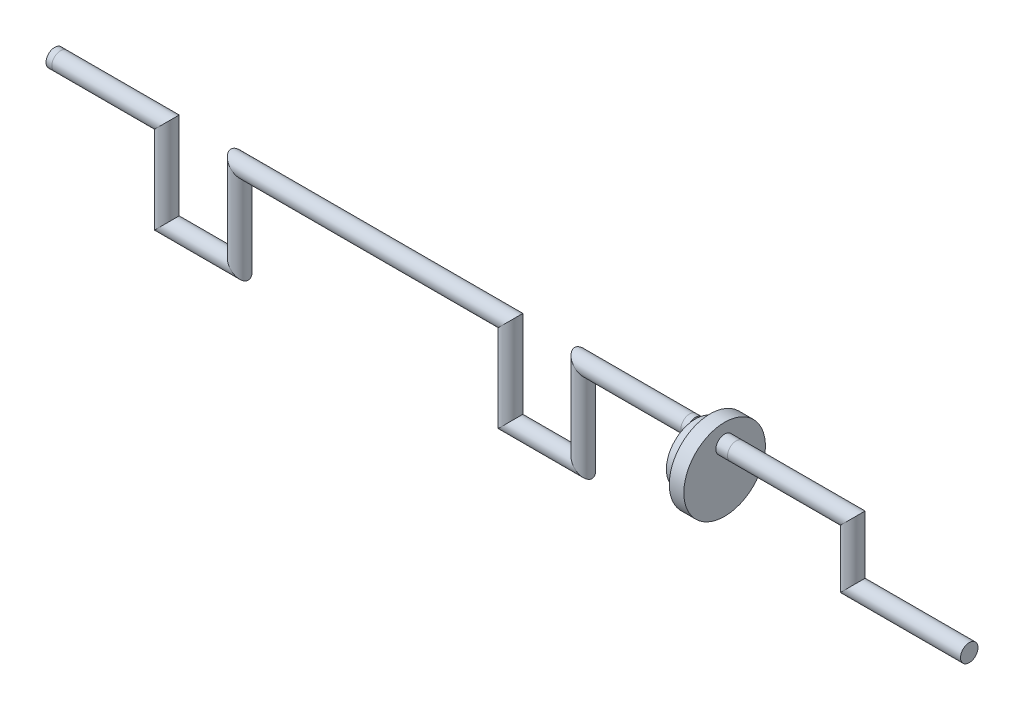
from build123d import *

# Parameters (mm, degrees)
SKETCH3_R           = 3
SKETCH4_R           = 14
BOSS_EXTRUDE1_DEPTH = 5
SKETCH5_R           = 10
BOSS_EXTRUDE2_DEPTH = 5
SKETCH9_R           = 3


with BuildPart() as part:
    # Sweep1: sweep along a path in Sketch2
    with BuildLine(Plane.XY) as sweep1_path:
        Line((80, -20), (40, -20))
        Line((40, -20), (40, 0))
        Line((40, 0), (0, 0))
        Line((0, 0), (-4, 0))
    # Sketch3 → Sweep1 (sweep)
    with BuildSketch(Plane(origin=(80, 0, 0), x_dir=(0, 0, -1), z_dir=(1, 0, 0))):
        with Locations((0, -20)):
            Circle(SKETCH3_R)
    sweep(path=sweep1_path.line, transition=Transition.RIGHT)

    # Sketch4 → Boss-Extrude1 (add)
    with BuildSketch(Plane.ZY.offset(4)):
        with Locations((0, -7.5)):
            Circle(SKETCH4_R)
    extrude(amount=BOSS_EXTRUDE1_DEPTH)

    # Sketch5 → Boss-Extrude2 (add)
    with BuildSketch(Plane.ZY.offset(9)):
        with Locations((0, -7.5)):
            Circle(SKETCH5_R)
    extrude(amount=BOSS_EXTRUDE2_DEPTH)

    # Sweep2: sweep along a path in Sketch8
    with BuildLine(Plane.XY) as sweep2_path:
        Line((-14, 0), (-16, 0))
        Line((-16, 0), (-52.5, 0))
        Line((-52.5, 0), (-52.5, -30))
        Line((-52.5, -30), (-77.5, -30))
        Line((-77.5, -30), (-77.5, 0))
        Line((-77.5, 0), (-170.5, 0))
        Line((-170.5, 0), (-170.5, -30))
        Line((-170.5, -30), (-195.5, -30))
        Line((-195.5, -30), (-195.5, 0))
        Line((-195.5, 0), (-232, 0))
        Line((-232, 0), (-234, 0))
    # Sketch9 → Sweep2 (sweep)
    with BuildSketch(Plane(origin=(-234, 0, 0), x_dir=(0, 0, -1), z_dir=(1, 0, 0))):
        Circle(SKETCH9_R)
    sweep(path=sweep2_path.line, transition=Transition.RIGHT)


solid = part.part
